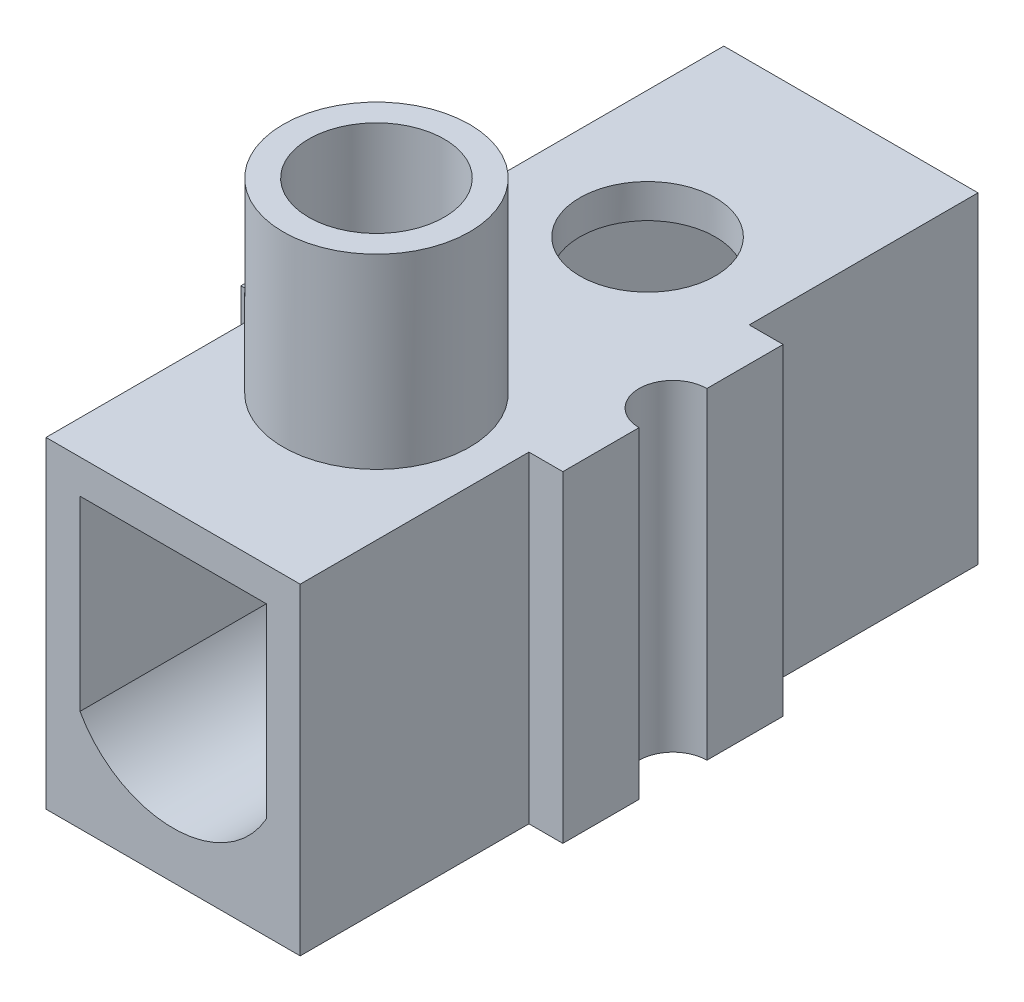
ISO-10303-21;
HEADER;
FILE_DESCRIPTION(('STEP AP214'),'2;1');
FILE_NAME('part.step','',(''),(''),'','','');
FILE_SCHEMA(('AUTOMOTIVE_DESIGN { 1 0 10303 214 1 1 1 1 }'));
ENDSEC;
DATA;
#1=APPLICATION_CONTEXT('core data for automotive mechanical design processes');
#2=APPLICATION_PROTOCOL_DEFINITION('international standard','automotive_design',2000,#1);
#3=PRODUCT_CONTEXT('',#1,'mechanical');
#4=PRODUCT('Part','Part','',(#3));
#5=PRODUCT_RELATED_PRODUCT_CATEGORY('part','',(#4));
#6=PRODUCT_DEFINITION_FORMATION('','',#4);
#7=PRODUCT_DEFINITION_CONTEXT('part definition',#1,'design');
#8=PRODUCT_DEFINITION('design','',#6,#7);
#9=PRODUCT_DEFINITION_SHAPE('','',#8);
#10=(LENGTH_UNIT() NAMED_UNIT(*) SI_UNIT(.MILLI.,.METRE.));
#11=(NAMED_UNIT(*) PLANE_ANGLE_UNIT() SI_UNIT($,.RADIAN.));
#12=(NAMED_UNIT(*) SI_UNIT($,.STERADIAN.) SOLID_ANGLE_UNIT());
#13=UNCERTAINTY_MEASURE_WITH_UNIT(LENGTH_MEASURE(1.E-05),#10,'distance_accuracy_value','');
#14=(GEOMETRIC_REPRESENTATION_CONTEXT(3) GLOBAL_UNCERTAINTY_ASSIGNED_CONTEXT((#13)) GLOBAL_UNIT_ASSIGNED_CONTEXT((#10,
#11,#12)) REPRESENTATION_CONTEXT('',''));
#15=CARTESIAN_POINT('',(0.,0.,0.));
#16=DIRECTION('',(0.,0.,1.));
#17=DIRECTION('',(1.,0.,0.));
#18=AXIS2_PLACEMENT_3D('',#15,#16,#17);
#19=CARTESIAN_POINT('',(-3.75,0.,10.));
#20=DIRECTION('',(0.,-1.,0.));
#21=DIRECTION('',(0.,0.,-1.));
#22=AXIS2_PLACEMENT_3D('',#19,#20,#21);
#23=PLANE('',#22);
#24=DIRECTION('',(0.,0.,1.));
#25=VECTOR('',#24,1.);
#26=CARTESIAN_POINT('',(-4.75,0.,3.25));
#27=LINE('',#26,#25);
#28=CARTESIAN_POINT('',(-4.75,0.,-3.25));
#29=VERTEX_POINT('',#28);
#30=CARTESIAN_POINT('',(-4.75,0.,-1.));
#31=VERTEX_POINT('',#30);
#32=EDGE_CURVE('E373',#29,#31,#27,.T.);
#33=ORIENTED_EDGE('',*,*,#32,.T.);
#34=CARTESIAN_POINT('',(-4.75,0.,0.));
#35=DIRECTION('',(0.,1.,0.));
#36=DIRECTION('',(0.,0.,-1.));
#37=AXIS2_PLACEMENT_3D('',#34,#35,#36);
#38=CIRCLE('',#37,1.);
#39=CARTESIAN_POINT('',(-4.75,0.,1.));
#40=VERTEX_POINT('',#39);
#41=EDGE_CURVE('E43',#40,#31,#38,.T.);
#42=ORIENTED_EDGE('',*,*,#41,.F.);
#43=CARTESIAN_POINT('',(-4.75,0.,3.25));
#44=VERTEX_POINT('',#43);
#45=EDGE_CURVE('E376',#40,#44,#27,.T.);
#46=ORIENTED_EDGE('',*,*,#45,.T.);
#47=DIRECTION('',(1.,0.,0.));
#48=VECTOR('',#47,1.);
#49=CARTESIAN_POINT('',(-4.75,0.,3.25));
#50=LINE('',#49,#48);
#51=CARTESIAN_POINT('',(-3.75,0.,3.25));
#52=VERTEX_POINT('',#51);
#53=EDGE_CURVE('E299',#44,#52,#50,.T.);
#54=ORIENTED_EDGE('',*,*,#53,.T.);
#55=DIRECTION('',(0.,0.,-1.));
#56=VECTOR('',#55,1.);
#57=CARTESIAN_POINT('',(-3.75,0.,10.));
#58=LINE('',#57,#56);
#59=CARTESIAN_POINT('',(-3.75,0.,10.));
#60=VERTEX_POINT('',#59);
#61=EDGE_CURVE('E263',#60,#52,#58,.T.);
#62=ORIENTED_EDGE('',*,*,#61,.F.);
#63=DIRECTION('',(-1.,0.,0.));
#64=VECTOR('',#63,1.);
#65=CARTESIAN_POINT('',(-3.75,0.,10.));
#66=LINE('',#65,#64);
#67=CARTESIAN_POINT('',(3.75,0.,10.));
#68=VERTEX_POINT('',#67);
#69=EDGE_CURVE('E252',#68,#60,#66,.T.);
#70=ORIENTED_EDGE('',*,*,#69,.F.);
#71=DIRECTION('',(0.,0.,-1.));
#72=VECTOR('',#71,1.);
#73=CARTESIAN_POINT('',(3.75,0.,10.));
#74=LINE('',#73,#72);
#75=CARTESIAN_POINT('',(3.75,0.,3.25));
#76=VERTEX_POINT('',#75);
#77=EDGE_CURVE('E275',#68,#76,#74,.T.);
#78=ORIENTED_EDGE('',*,*,#77,.T.);
#79=DIRECTION('',(-1.,0.,0.));
#80=VECTOR('',#79,1.);
#81=CARTESIAN_POINT('',(4.75,0.,3.25));
#82=LINE('',#81,#80);
#83=CARTESIAN_POINT('',(4.75,0.,3.25));
#84=VERTEX_POINT('',#83);
#85=EDGE_CURVE('E200',#84,#76,#82,.T.);
#86=ORIENTED_EDGE('',*,*,#85,.F.);
#87=DIRECTION('',(0.,0.,1.));
#88=VECTOR('',#87,1.);
#89=CARTESIAN_POINT('',(4.75,0.,3.25));
#90=LINE('',#89,#88);
#91=CARTESIAN_POINT('',(4.75,0.,1.));
#92=VERTEX_POINT('',#91);
#93=EDGE_CURVE('E192',#92,#84,#90,.T.);
#94=ORIENTED_EDGE('',*,*,#93,.F.);
#95=CARTESIAN_POINT('',(4.75,0.,0.));
#96=DIRECTION('',(0.,1.,0.));
#97=DIRECTION('',(0.,0.,1.));
#98=AXIS2_PLACEMENT_3D('',#95,#96,#97);
#99=CIRCLE('',#98,1.);
#100=CARTESIAN_POINT('',(4.75,0.,-1.));
#101=VERTEX_POINT('',#100);
#102=EDGE_CURVE('E168',#101,#92,#99,.T.);
#103=ORIENTED_EDGE('',*,*,#102,.F.);
#104=CARTESIAN_POINT('',(4.75,0.,-3.25));
#105=VERTEX_POINT('',#104);
#106=EDGE_CURVE('E197',#105,#101,#90,.T.);
#107=ORIENTED_EDGE('',*,*,#106,.F.);
#108=DIRECTION('',(-1.,0.,0.));
#109=VECTOR('',#108,1.);
#110=CARTESIAN_POINT('',(4.75,0.,-3.25));
#111=LINE('',#110,#109);
#112=CARTESIAN_POINT('',(3.75,0.,-3.25));
#113=VERTEX_POINT('',#112);
#114=EDGE_CURVE('E287',#105,#113,#111,.T.);
#115=ORIENTED_EDGE('',*,*,#114,.T.);
#116=CARTESIAN_POINT('',(3.75,0.,-10.));
#117=VERTEX_POINT('',#116);
#118=EDGE_CURVE('E266',#113,#117,#74,.T.);
#119=ORIENTED_EDGE('',*,*,#118,.T.);
#120=DIRECTION('',(-1.,0.,0.));
#121=VECTOR('',#120,1.);
#122=CARTESIAN_POINT('',(-3.75,0.,-10.));
#123=LINE('',#122,#121);
#124=CARTESIAN_POINT('',(-3.75,0.,-10.));
#125=VERTEX_POINT('',#124);
#126=EDGE_CURVE('E242',#117,#125,#123,.T.);
#127=ORIENTED_EDGE('',*,*,#126,.T.);
#128=CARTESIAN_POINT('',(-3.75,0.,-3.25));
#129=VERTEX_POINT('',#128);
#130=EDGE_CURVE('E254',#129,#125,#58,.T.);
#131=ORIENTED_EDGE('',*,*,#130,.F.);
#132=DIRECTION('',(1.,0.,0.));
#133=VECTOR('',#132,1.);
#134=CARTESIAN_POINT('',(-4.75,0.,-3.25));
#135=LINE('',#134,#133);
#136=EDGE_CURVE('E360',#29,#129,#135,.T.);
#137=ORIENTED_EDGE('',*,*,#136,.F.);
#138=EDGE_LOOP('',(#33,#42,#46,#54,#62,#70,#78,#86,#94,#103,#107,#115,#119,#127,#131,#137));
#139=FACE_BOUND('',#138,.T.);
#140=CARTESIAN_POINT('',(0.,0.,-4.));
#141=DIRECTION('',(0.,1.,0.));
#142=DIRECTION('',(0.,0.,1.));
#143=AXIS2_PLACEMENT_3D('',#140,#141,#142);
#144=CIRCLE('',#143,2.);
#145=CARTESIAN_POINT('',(0.,0.,-2.));
#146=VERTEX_POINT('',#145);
#147=EDGE_CURVE('E391',#146,#146,#144,.T.);
#148=ORIENTED_EDGE('',*,*,#147,.F.);
#149=EDGE_LOOP('',(#148));
#150=FACE_BOUND('',#149,.T.);
#151=CARTESIAN_POINT('',(0.,0.,4.));
#152=DIRECTION('',(0.,-1.,0.));
#153=DIRECTION('',(0.,0.,-1.));
#154=AXIS2_PLACEMENT_3D('',#151,#152,#153);
#155=CIRCLE('',#154,2.75);
#156=CARTESIAN_POINT('',(0.,0.,1.25));
#157=VERTEX_POINT('',#156);
#158=EDGE_CURVE('E11',#157,#157,#155,.F.);
#159=ORIENTED_EDGE('',*,*,#158,.F.);
#160=EDGE_LOOP('',(#159));
#161=FACE_BOUND('',#160,.T.);
#162=ADVANCED_FACE('F26',(#139,#150,#161),#23,.F.);
#163=CARTESIAN_POINT('',(-4.75,0.,3.25));
#164=DIRECTION('',(-1.,0.,0.));
#165=DIRECTION('',(0.,1.,0.));
#166=AXIS2_PLACEMENT_3D('',#163,#164,#165);
#167=PLANE('',#166);
#168=DIRECTION('',(0.,1.,0.));
#169=VECTOR('',#168,1.);
#170=CARTESIAN_POINT('',(-4.75,-9.50005,0.999999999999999));
#171=LINE('',#170,#169);
#172=CARTESIAN_POINT('',(-4.75,-9.5,0.999999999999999));
#173=VERTEX_POINT('',#172);
#174=EDGE_CURVE('E35',#173,#40,#171,.T.);
#175=ORIENTED_EDGE('',*,*,#174,.F.);
#176=DIRECTION('',(0.,0.,-1.));
#177=VECTOR('',#176,1.);
#178=CARTESIAN_POINT('',(-4.75,-9.5,3.25));
#179=LINE('',#178,#177);
#180=CARTESIAN_POINT('',(-4.75,-9.5,3.25));
#181=VERTEX_POINT('',#180);
#182=EDGE_CURVE('E293',#181,#173,#179,.T.);
#183=ORIENTED_EDGE('',*,*,#182,.F.);
#184=DIRECTION('',(0.,-1.,0.));
#185=VECTOR('',#184,1.);
#186=CARTESIAN_POINT('',(-4.75,0.,3.25));
#187=LINE('',#186,#185);
#188=EDGE_CURVE('E345',#44,#181,#187,.T.);
#189=ORIENTED_EDGE('',*,*,#188,.F.);
#190=ORIENTED_EDGE('',*,*,#45,.F.);
#191=EDGE_LOOP('',(#175,#183,#189,#190));
#192=FACE_BOUND('',#191,.T.);
#193=ADVANCED_FACE('F382',(#192),#167,.T.);
#194=CARTESIAN_POINT('',(4.75,0.,3.25));
#195=DIRECTION('',(1.,0.,0.));
#196=DIRECTION('',(0.,1.,0.));
#197=AXIS2_PLACEMENT_3D('',#194,#195,#196);
#198=PLANE('',#197);
#199=DIRECTION('',(0.,1.,0.));
#200=VECTOR('',#199,1.);
#201=CARTESIAN_POINT('',(4.75,-9.50005,-1.));
#202=LINE('',#201,#200);
#203=CARTESIAN_POINT('',(4.75,-9.5,-1.));
#204=VERTEX_POINT('',#203);
#205=EDGE_CURVE('E172',#204,#101,#202,.T.);
#206=ORIENTED_EDGE('',*,*,#205,.F.);
#207=DIRECTION('',(0.,0.,-1.));
#208=VECTOR('',#207,1.);
#209=CARTESIAN_POINT('',(4.75,-9.5,3.25));
#210=LINE('',#209,#208);
#211=CARTESIAN_POINT('',(4.75,-9.5,-3.25));
#212=VERTEX_POINT('',#211);
#213=EDGE_CURVE('E183',#204,#212,#210,.T.);
#214=ORIENTED_EDGE('',*,*,#213,.T.);
#215=DIRECTION('',(0.,1.,0.));
#216=VECTOR('',#215,1.);
#217=CARTESIAN_POINT('',(4.75,0.,-3.25));
#218=LINE('',#217,#216);
#219=EDGE_CURVE('E190',#212,#105,#218,.T.);
#220=ORIENTED_EDGE('',*,*,#219,.T.);
#221=ORIENTED_EDGE('',*,*,#106,.T.);
#222=EDGE_LOOP('',(#206,#214,#220,#221));
#223=FACE_BOUND('',#222,.T.);
#224=ADVANCED_FACE('F427',(#223),#198,.T.);
#225=CARTESIAN_POINT('',(-3.75,0.,10.));
#226=DIRECTION('',(1.,0.,0.));
#227=DIRECTION('',(0.,1.,0.));
#228=AXIS2_PLACEMENT_3D('',#225,#226,#227);
#229=PLANE('',#228);
#230=ORIENTED_EDGE('',*,*,#61,.T.);
#231=DIRECTION('',(0.,-1.,0.));
#232=VECTOR('',#231,1.);
#233=CARTESIAN_POINT('',(-3.75,0.,3.25));
#234=LINE('',#233,#232);
#235=CARTESIAN_POINT('',(-3.75,-9.5,3.25));
#236=VERTEX_POINT('',#235);
#237=EDGE_CURVE('E184',#52,#236,#234,.T.);
#238=ORIENTED_EDGE('',*,*,#237,.T.);
#239=DIRECTION('',(0.,0.,-1.));
#240=VECTOR('',#239,1.);
#241=CARTESIAN_POINT('',(-3.75,-9.5,10.));
#242=LINE('',#241,#240);
#243=CARTESIAN_POINT('',(-3.75,-9.5,10.));
#244=VERTEX_POINT('',#243);
#245=EDGE_CURVE('E173',#244,#236,#242,.T.);
#246=ORIENTED_EDGE('',*,*,#245,.F.);
#247=DIRECTION('',(0.,-1.,0.));
#248=VECTOR('',#247,1.);
#249=CARTESIAN_POINT('',(-3.75,0.,10.));
#250=LINE('',#249,#248);
#251=EDGE_CURVE('E245',#60,#244,#250,.T.);
#252=ORIENTED_EDGE('',*,*,#251,.F.);
#253=EDGE_LOOP('',(#230,#238,#246,#252));
#254=FACE_BOUND('',#253,.T.);
#255=ADVANCED_FACE('F338',(#254),#229,.F.);
#256=CARTESIAN_POINT('',(3.75,0.,10.));
#257=DIRECTION('',(-1.,0.,0.));
#258=DIRECTION('',(0.,-1.,0.));
#259=AXIS2_PLACEMENT_3D('',#256,#257,#258);
#260=PLANE('',#259);
#261=DIRECTION('',(0.,-1.,0.));
#262=VECTOR('',#261,1.);
#263=CARTESIAN_POINT('',(3.75,0.,3.25));
#264=LINE('',#263,#262);
#265=CARTESIAN_POINT('',(3.75,-9.5,3.25));
#266=VERTEX_POINT('',#265);
#267=EDGE_CURVE('E286',#76,#266,#264,.T.);
#268=ORIENTED_EDGE('',*,*,#267,.F.);
#269=ORIENTED_EDGE('',*,*,#77,.F.);
#270=DIRECTION('',(0.,1.,0.));
#271=VECTOR('',#270,1.);
#272=CARTESIAN_POINT('',(3.75,0.,10.));
#273=LINE('',#272,#271);
#274=CARTESIAN_POINT('',(3.75,-9.5,10.));
#275=VERTEX_POINT('',#274);
#276=EDGE_CURVE('E250',#275,#68,#273,.T.);
#277=ORIENTED_EDGE('',*,*,#276,.F.);
#278=DIRECTION('',(0.,0.,-1.));
#279=VECTOR('',#278,1.);
#280=CARTESIAN_POINT('',(3.75,-9.5,10.));
#281=LINE('',#280,#279);
#282=EDGE_CURVE('E270',#275,#266,#281,.T.);
#283=ORIENTED_EDGE('',*,*,#282,.T.);
#284=EDGE_LOOP('',(#268,#269,#277,#283));
#285=FACE_BOUND('',#284,.T.);
#286=ADVANCED_FACE('F323',(#285),#260,.F.);
#287=DIRECTION('',(0.,1.,0.));
#288=VECTOR('',#287,1.);
#289=CARTESIAN_POINT('',(3.75,0.,-3.25));
#290=LINE('',#289,#288);
#291=CARTESIAN_POINT('',(3.75,-9.5,-3.25));
#292=VERTEX_POINT('',#291);
#293=EDGE_CURVE('E283',#292,#113,#290,.T.);
#294=ORIENTED_EDGE('',*,*,#293,.F.);
#295=CARTESIAN_POINT('',(3.75,-9.5,-10.));
#296=VERTEX_POINT('',#295);
#297=EDGE_CURVE('E279',#292,#296,#281,.T.);
#298=ORIENTED_EDGE('',*,*,#297,.T.);
#299=DIRECTION('',(0.,1.,0.));
#300=VECTOR('',#299,1.);
#301=CARTESIAN_POINT('',(3.75,0.,-10.));
#302=LINE('',#301,#300);
#303=EDGE_CURVE('E239',#296,#117,#302,.T.);
#304=ORIENTED_EDGE('',*,*,#303,.T.);
#305=ORIENTED_EDGE('',*,*,#118,.F.);
#306=EDGE_LOOP('',(#294,#298,#304,#305));
#307=FACE_BOUND('',#306,.T.);
#308=ADVANCED_FACE('F434',(#307),#260,.F.);
#309=CARTESIAN_POINT('',(-3.75,-9.5,10.));
#310=DIRECTION('',(0.,0.,1.));
#311=DIRECTION('',(1.,0.,0.));
#312=AXIS2_PLACEMENT_3D('',#309,#310,#311);
#313=PLANE('',#312);
#314=ORIENTED_EDGE('',*,*,#251,.T.);
#315=DIRECTION('',(1.,0.,0.));
#316=VECTOR('',#315,1.);
#317=CARTESIAN_POINT('',(-3.75,-9.5,10.));
#318=LINE('',#317,#316);
#319=EDGE_CURVE('E248',#244,#275,#318,.T.);
#320=ORIENTED_EDGE('',*,*,#319,.T.);
#321=ORIENTED_EDGE('',*,*,#276,.T.);
#322=ORIENTED_EDGE('',*,*,#69,.T.);
#323=EDGE_LOOP('',(#314,#320,#321,#322));
#324=FACE_BOUND('',#323,.T.);
#325=CARTESIAN_POINT('',(0.00129666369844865,-4.96145199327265,10.));
#326=DIRECTION('',(0.,0.,1.));
#327=DIRECTION('',(1.,0.,0.));
#328=AXIS2_PLACEMENT_3D('',#325,#326,#327);
#329=CIRCLE('',#328,3.15);
#330=CARTESIAN_POINT('',(-2.74740667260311,-6.5,10.));
#331=VERTEX_POINT('',#330);
#332=CARTESIAN_POINT('',(2.75,-6.5,10.));
#333=VERTEX_POINT('',#332);
#334=EDGE_CURVE('E216',#331,#333,#329,.T.);
#335=ORIENTED_EDGE('',*,*,#334,.F.);
#336=DIRECTION('',(0.,-1.,0.));
#337=VECTOR('',#336,1.);
#338=CARTESIAN_POINT('',(-2.74740667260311,-1.,10.));
#339=LINE('',#338,#337);
#340=CARTESIAN_POINT('',(-2.74740667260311,-1.,10.));
#341=VERTEX_POINT('',#340);
#342=EDGE_CURVE('E214',#341,#331,#339,.T.);
#343=ORIENTED_EDGE('',*,*,#342,.F.);
#344=DIRECTION('',(-1.,0.,0.));
#345=VECTOR('',#344,1.);
#346=CARTESIAN_POINT('',(-2.74740667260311,-1.,10.));
#347=LINE('',#346,#345);
#348=CARTESIAN_POINT('',(2.75,-1.,10.));
#349=VERTEX_POINT('',#348);
#350=EDGE_CURVE('E221',#349,#341,#347,.T.);
#351=ORIENTED_EDGE('',*,*,#350,.F.);
#352=DIRECTION('',(0.,1.,0.));
#353=VECTOR('',#352,1.);
#354=CARTESIAN_POINT('',(2.75,-1.,10.));
#355=LINE('',#354,#353);
#356=EDGE_CURVE('E218',#333,#349,#355,.T.);
#357=ORIENTED_EDGE('',*,*,#356,.F.);
#358=EDGE_LOOP('',(#335,#343,#351,#357));
#359=FACE_BOUND('',#358,.T.);
#360=ADVANCED_FACE('F330',(#324,#359),#313,.T.);
#361=CARTESIAN_POINT('',(-3.75,-9.5,-10.));
#362=DIRECTION('',(0.,0.,1.));
#363=DIRECTION('',(1.,0.,0.));
#364=AXIS2_PLACEMENT_3D('',#361,#362,#363);
#365=PLANE('',#364);
#366=DIRECTION('',(0.,-1.,0.));
#367=VECTOR('',#366,1.);
#368=CARTESIAN_POINT('',(-3.75,0.,-10.));
#369=LINE('',#368,#367);
#370=CARTESIAN_POINT('',(-3.75,-9.5,-10.));
#371=VERTEX_POINT('',#370);
#372=EDGE_CURVE('E233',#125,#371,#369,.T.);
#373=ORIENTED_EDGE('',*,*,#372,.F.);
#374=ORIENTED_EDGE('',*,*,#126,.F.);
#375=ORIENTED_EDGE('',*,*,#303,.F.);
#376=DIRECTION('',(1.,0.,0.));
#377=VECTOR('',#376,1.);
#378=CARTESIAN_POINT('',(-3.75,-9.5,-10.));
#379=LINE('',#378,#377);
#380=EDGE_CURVE('E236',#371,#296,#379,.T.);
#381=ORIENTED_EDGE('',*,*,#380,.F.);
#382=EDGE_LOOP('',(#373,#374,#375,#381));
#383=FACE_BOUND('',#382,.T.);
#384=DIRECTION('',(0.,-1.,0.));
#385=VECTOR('',#384,1.);
#386=CARTESIAN_POINT('',(-2.74740667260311,-1.,-10.));
#387=LINE('',#386,#385);
#388=CARTESIAN_POINT('',(-2.74740667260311,-1.,-10.));
#389=VERTEX_POINT('',#388);
#390=CARTESIAN_POINT('',(-2.74740667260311,-6.5,-10.));
#391=VERTEX_POINT('',#390);
#392=EDGE_CURVE('E201',#389,#391,#387,.T.);
#393=ORIENTED_EDGE('',*,*,#392,.T.);
#394=CARTESIAN_POINT('',(0.00129666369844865,-4.96145199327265,-10.));
#395=DIRECTION('',(0.,0.,1.));
#396=DIRECTION('',(1.,0.,0.));
#397=AXIS2_PLACEMENT_3D('',#394,#395,#396);
#398=CIRCLE('',#397,3.15);
#399=CARTESIAN_POINT('',(2.75,-6.5,-10.));
#400=VERTEX_POINT('',#399);
#401=EDGE_CURVE('E204',#391,#400,#398,.T.);
#402=ORIENTED_EDGE('',*,*,#401,.T.);
#403=DIRECTION('',(0.,1.,0.));
#404=VECTOR('',#403,1.);
#405=CARTESIAN_POINT('',(2.75,-1.,-10.));
#406=LINE('',#405,#404);
#407=CARTESIAN_POINT('',(2.75,-1.,-10.));
#408=VERTEX_POINT('',#407);
#409=EDGE_CURVE('E208',#400,#408,#406,.T.);
#410=ORIENTED_EDGE('',*,*,#409,.T.);
#411=DIRECTION('',(-1.,0.,0.));
#412=VECTOR('',#411,1.);
#413=CARTESIAN_POINT('',(-2.74740667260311,-1.,-10.));
#414=LINE('',#413,#412);
#415=EDGE_CURVE('E211',#408,#389,#414,.T.);
#416=ORIENTED_EDGE('',*,*,#415,.T.);
#417=EDGE_LOOP('',(#393,#402,#410,#416));
#418=FACE_BOUND('',#417,.T.);
#419=ADVANCED_FACE('F446',(#383,#418),#365,.F.);
#420=CARTESIAN_POINT('',(-3.75,-9.5,-3.25));
#421=VERTEX_POINT('',#420);
#422=EDGE_CURVE('E267',#421,#371,#242,.T.);
#423=ORIENTED_EDGE('',*,*,#422,.F.);
#424=DIRECTION('',(0.,1.,0.));
#425=VECTOR('',#424,1.);
#426=CARTESIAN_POINT('',(-3.75,0.,-3.25));
#427=LINE('',#426,#425);
#428=EDGE_CURVE('E342',#421,#129,#427,.T.);
#429=ORIENTED_EDGE('',*,*,#428,.T.);
#430=ORIENTED_EDGE('',*,*,#130,.T.);
#431=ORIENTED_EDGE('',*,*,#372,.T.);
#432=EDGE_LOOP('',(#423,#429,#430,#431));
#433=FACE_BOUND('',#432,.T.);
#434=ADVANCED_FACE('F28',(#433),#229,.F.);
#435=CARTESIAN_POINT('',(-3.75,-9.5,10.));
#436=DIRECTION('',(0.,1.,0.));
#437=DIRECTION('',(0.,0.,1.));
#438=AXIS2_PLACEMENT_3D('',#435,#436,#437);
#439=PLANE('',#438);
#440=ORIENTED_EDGE('',*,*,#182,.T.);
#441=CARTESIAN_POINT('',(-4.75,-9.5,0.));
#442=DIRECTION('',(0.,1.,0.));
#443=DIRECTION('',(0.,0.,1.));
#444=AXIS2_PLACEMENT_3D('',#441,#442,#443);
#445=CIRCLE('',#444,1.);
#446=CARTESIAN_POINT('',(-4.75,-9.5,-1.));
#447=VERTEX_POINT('',#446);
#448=EDGE_CURVE('E55',#173,#447,#445,.T.);
#449=ORIENTED_EDGE('',*,*,#448,.T.);
#450=CARTESIAN_POINT('',(-4.75,-9.5,-3.25));
#451=VERTEX_POINT('',#450);
#452=EDGE_CURVE('E367',#447,#451,#179,.T.);
#453=ORIENTED_EDGE('',*,*,#452,.T.);
#454=DIRECTION('',(1.,0.,0.));
#455=VECTOR('',#454,1.);
#456=CARTESIAN_POINT('',(-4.75,-9.5,-3.25));
#457=LINE('',#456,#455);
#458=EDGE_CURVE('E362',#451,#421,#457,.T.);
#459=ORIENTED_EDGE('',*,*,#458,.T.);
#460=ORIENTED_EDGE('',*,*,#422,.T.);
#461=ORIENTED_EDGE('',*,*,#380,.T.);
#462=ORIENTED_EDGE('',*,*,#297,.F.);
#463=DIRECTION('',(-1.,0.,0.));
#464=VECTOR('',#463,1.);
#465=CARTESIAN_POINT('',(4.75,-9.5,-3.25));
#466=LINE('',#465,#464);
#467=EDGE_CURVE('E307',#212,#292,#466,.T.);
#468=ORIENTED_EDGE('',*,*,#467,.F.);
#469=ORIENTED_EDGE('',*,*,#213,.F.);
#470=CARTESIAN_POINT('',(4.75,-9.5,0.));
#471=DIRECTION('',(0.,1.,0.));
#472=DIRECTION('',(0.,0.,1.));
#473=AXIS2_PLACEMENT_3D('',#470,#471,#472);
#474=CIRCLE('',#473,1.);
#475=CARTESIAN_POINT('',(4.75,-9.5,0.999999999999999));
#476=VERTEX_POINT('',#475);
#477=EDGE_CURVE('E162',#204,#476,#474,.T.);
#478=ORIENTED_EDGE('',*,*,#477,.T.);
#479=CARTESIAN_POINT('',(4.75,-9.5,3.25));
#480=VERTEX_POINT('',#479);
#481=EDGE_CURVE('E180',#480,#476,#210,.T.);
#482=ORIENTED_EDGE('',*,*,#481,.F.);
#483=DIRECTION('',(-1.,0.,0.));
#484=VECTOR('',#483,1.);
#485=CARTESIAN_POINT('',(4.75,-9.5,3.25));
#486=LINE('',#485,#484);
#487=EDGE_CURVE('E205',#480,#266,#486,.T.);
#488=ORIENTED_EDGE('',*,*,#487,.T.);
#489=ORIENTED_EDGE('',*,*,#282,.F.);
#490=ORIENTED_EDGE('',*,*,#319,.F.);
#491=ORIENTED_EDGE('',*,*,#245,.T.);
#492=DIRECTION('',(1.,0.,0.));
#493=VECTOR('',#492,1.);
#494=CARTESIAN_POINT('',(-4.75,-9.5,3.25));
#495=LINE('',#494,#493);
#496=EDGE_CURVE('E334',#181,#236,#495,.T.);
#497=ORIENTED_EDGE('',*,*,#496,.F.);
#498=EDGE_LOOP('',(#440,#449,#453,#459,#460,#461,#462,#468,#469,#478,#482,#488,#489,#490,#491,#497));
#499=FACE_BOUND('',#498,.T.);
#500=ADVANCED_FACE('F178',(#499),#439,.F.);
#501=CARTESIAN_POINT('',(-2.74740667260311,-1.,10.));
#502=DIRECTION('',(1.,0.,0.));
#503=DIRECTION('',(0.,1.,0.));
#504=AXIS2_PLACEMENT_3D('',#501,#502,#503);
#505=PLANE('',#504);
#506=ORIENTED_EDGE('',*,*,#392,.F.);
#507=DIRECTION('',(0.,0.,-1.));
#508=VECTOR('',#507,1.);
#509=CARTESIAN_POINT('',(-2.74740667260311,-1.,10.));
#510=LINE('',#509,#508);
#511=EDGE_CURVE('E223',#341,#389,#510,.T.);
#512=ORIENTED_EDGE('',*,*,#511,.F.);
#513=ORIENTED_EDGE('',*,*,#342,.T.);
#514=DIRECTION('',(0.,0.,-1.));
#515=VECTOR('',#514,1.);
#516=CARTESIAN_POINT('',(-2.74740667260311,-6.5,10.));
#517=LINE('',#516,#515);
#518=EDGE_CURVE('E230',#331,#391,#517,.T.);
#519=ORIENTED_EDGE('',*,*,#518,.T.);
#520=EDGE_LOOP('',(#506,#512,#513,#519));
#521=FACE_BOUND('',#520,.T.);
#522=ADVANCED_FACE('F436',(#521),#505,.T.);
#523=CARTESIAN_POINT('',(0.00129666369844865,-4.96145199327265,10.));
#524=DIRECTION('',(0.,0.,-1.));
#525=DIRECTION('',(-1.,0.,0.));
#526=AXIS2_PLACEMENT_3D('',#523,#524,#525);
#527=CYLINDRICAL_SURFACE('',#526,3.15);
#528=ORIENTED_EDGE('',*,*,#401,.F.);
#529=ORIENTED_EDGE('',*,*,#518,.F.);
#530=ORIENTED_EDGE('',*,*,#334,.T.);
#531=DIRECTION('',(0.,0.,-1.));
#532=VECTOR('',#531,1.);
#533=CARTESIAN_POINT('',(2.75,-6.5,10.));
#534=LINE('',#533,#532);
#535=EDGE_CURVE('E228',#333,#400,#534,.T.);
#536=ORIENTED_EDGE('',*,*,#535,.T.);
#537=EDGE_LOOP('',(#528,#529,#530,#536));
#538=FACE_BOUND('',#537,.T.);
#539=ADVANCED_FACE('F442',(#538),#527,.F.);
#540=CARTESIAN_POINT('',(2.75,-1.,10.));
#541=DIRECTION('',(-1.,0.,0.));
#542=DIRECTION('',(0.,-1.,0.));
#543=AXIS2_PLACEMENT_3D('',#540,#541,#542);
#544=PLANE('',#543);
#545=ORIENTED_EDGE('',*,*,#409,.F.);
#546=ORIENTED_EDGE('',*,*,#535,.F.);
#547=ORIENTED_EDGE('',*,*,#356,.T.);
#548=DIRECTION('',(0.,0.,-1.));
#549=VECTOR('',#548,1.);
#550=CARTESIAN_POINT('',(2.75,-1.,10.));
#551=LINE('',#550,#549);
#552=EDGE_CURVE('E226',#349,#408,#551,.T.);
#553=ORIENTED_EDGE('',*,*,#552,.T.);
#554=EDGE_LOOP('',(#545,#546,#547,#553));
#555=FACE_BOUND('',#554,.T.);
#556=ADVANCED_FACE('F477',(#555),#544,.T.);
#557=CARTESIAN_POINT('',(-2.74740667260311,-1.,10.));
#558=DIRECTION('',(0.,-1.,0.));
#559=DIRECTION('',(0.,0.,-1.));
#560=AXIS2_PLACEMENT_3D('',#557,#558,#559);
#561=PLANE('',#560);
#562=CARTESIAN_POINT('',(0.,-1.,-4.));
#563=DIRECTION('',(0.,-1.,0.));
#564=DIRECTION('',(0.,0.,-1.));
#565=AXIS2_PLACEMENT_3D('',#562,#563,#564);
#566=CIRCLE('',#565,2.);
#567=CARTESIAN_POINT('',(0.,-1.,-6.));
#568=VERTEX_POINT('',#567);
#569=EDGE_CURVE('E389',#568,#568,#566,.T.);
#570=ORIENTED_EDGE('',*,*,#569,.F.);
#571=EDGE_LOOP('',(#570));
#572=FACE_BOUND('',#571,.T.);
#573=CARTESIAN_POINT('',(0.,-1.,4.));
#574=DIRECTION('',(0.,-1.,0.));
#575=DIRECTION('',(0.,0.,-1.));
#576=AXIS2_PLACEMENT_3D('',#573,#574,#575);
#577=CIRCLE('',#576,2.);
#578=CARTESIAN_POINT('',(0.,-1.,2.));
#579=VERTEX_POINT('',#578);
#580=EDGE_CURVE('E387',#579,#579,#577,.T.);
#581=ORIENTED_EDGE('',*,*,#580,.F.);
#582=EDGE_LOOP('',(#581));
#583=FACE_BOUND('',#582,.T.);
#584=ORIENTED_EDGE('',*,*,#415,.F.);
#585=ORIENTED_EDGE('',*,*,#552,.F.);
#586=ORIENTED_EDGE('',*,*,#350,.T.);
#587=ORIENTED_EDGE('',*,*,#511,.T.);
#588=EDGE_LOOP('',(#584,#585,#586,#587));
#589=FACE_BOUND('',#588,.T.);
#590=ADVANCED_FACE('F472',(#572,#583,#589),#561,.T.);
#591=CARTESIAN_POINT('',(4.75,0.,3.25));
#592=DIRECTION('',(0.,0.,-1.));
#593=DIRECTION('',(0.,1.,0.));
#594=AXIS2_PLACEMENT_3D('',#591,#592,#593);
#595=PLANE('',#594);
#596=ORIENTED_EDGE('',*,*,#267,.T.);
#597=ORIENTED_EDGE('',*,*,#487,.F.);
#598=DIRECTION('',(0.,-1.,0.));
#599=VECTOR('',#598,1.);
#600=CARTESIAN_POINT('',(4.75,0.,3.25));
#601=LINE('',#600,#599);
#602=EDGE_CURVE('E188',#84,#480,#601,.T.);
#603=ORIENTED_EDGE('',*,*,#602,.F.);
#604=ORIENTED_EDGE('',*,*,#85,.T.);
#605=EDGE_LOOP('',(#596,#597,#603,#604));
#606=FACE_BOUND('',#605,.T.);
#607=ADVANCED_FACE('F320',(#606),#595,.F.);
#608=CARTESIAN_POINT('',(4.75,0.,-3.25));
#609=DIRECTION('',(0.,0.,1.));
#610=DIRECTION('',(0.,-1.,0.));
#611=AXIS2_PLACEMENT_3D('',#608,#609,#610);
#612=PLANE('',#611);
#613=ORIENTED_EDGE('',*,*,#293,.T.);
#614=ORIENTED_EDGE('',*,*,#114,.F.);
#615=ORIENTED_EDGE('',*,*,#219,.F.);
#616=ORIENTED_EDGE('',*,*,#467,.T.);
#617=EDGE_LOOP('',(#613,#614,#615,#616));
#618=FACE_BOUND('',#617,.T.);
#619=ADVANCED_FACE('F464',(#618),#612,.F.);
#620=DIRECTION('',(0.,1.,0.));
#621=VECTOR('',#620,1.);
#622=CARTESIAN_POINT('',(4.75,-9.50005,0.999999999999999));
#623=LINE('',#622,#621);
#624=EDGE_CURVE('E165',#92,#476,#623,.F.);
#625=ORIENTED_EDGE('',*,*,#624,.F.);
#626=ORIENTED_EDGE('',*,*,#93,.T.);
#627=ORIENTED_EDGE('',*,*,#602,.T.);
#628=ORIENTED_EDGE('',*,*,#481,.T.);
#629=EDGE_LOOP('',(#625,#626,#627,#628));
#630=FACE_BOUND('',#629,.T.);
#631=ADVANCED_FACE('F186',(#630),#198,.T.);
#632=CARTESIAN_POINT('',(-4.75,0.,3.25));
#633=DIRECTION('',(0.,0.,1.));
#634=DIRECTION('',(0.,-1.,0.));
#635=AXIS2_PLACEMENT_3D('',#632,#633,#634);
#636=PLANE('',#635);
#637=ORIENTED_EDGE('',*,*,#237,.F.);
#638=ORIENTED_EDGE('',*,*,#53,.F.);
#639=ORIENTED_EDGE('',*,*,#188,.T.);
#640=ORIENTED_EDGE('',*,*,#496,.T.);
#641=EDGE_LOOP('',(#637,#638,#639,#640));
#642=FACE_BOUND('',#641,.T.);
#643=ADVANCED_FACE('F380',(#642),#636,.T.);
#644=CARTESIAN_POINT('',(-4.75,0.,-3.25));
#645=DIRECTION('',(0.,0.,-1.));
#646=DIRECTION('',(0.,1.,0.));
#647=AXIS2_PLACEMENT_3D('',#644,#645,#646);
#648=PLANE('',#647);
#649=ORIENTED_EDGE('',*,*,#428,.F.);
#650=ORIENTED_EDGE('',*,*,#458,.F.);
#651=DIRECTION('',(0.,1.,0.));
#652=VECTOR('',#651,1.);
#653=CARTESIAN_POINT('',(-4.75,0.,-3.25));
#654=LINE('',#653,#652);
#655=EDGE_CURVE('E369',#451,#29,#654,.T.);
#656=ORIENTED_EDGE('',*,*,#655,.T.);
#657=ORIENTED_EDGE('',*,*,#136,.T.);
#658=EDGE_LOOP('',(#649,#650,#656,#657));
#659=FACE_BOUND('',#658,.T.);
#660=ADVANCED_FACE('F468',(#659),#648,.T.);
#661=DIRECTION('',(0.,1.,0.));
#662=VECTOR('',#661,1.);
#663=CARTESIAN_POINT('',(-4.75,-9.50005,-1.));
#664=LINE('',#663,#662);
#665=EDGE_CURVE('E60',#31,#447,#664,.F.);
#666=ORIENTED_EDGE('',*,*,#665,.F.);
#667=ORIENTED_EDGE('',*,*,#32,.F.);
#668=ORIENTED_EDGE('',*,*,#655,.F.);
#669=ORIENTED_EDGE('',*,*,#452,.F.);
#670=EDGE_LOOP('',(#666,#667,#668,#669));
#671=FACE_BOUND('',#670,.T.);
#672=ADVANCED_FACE('F429',(#671),#167,.T.);
#673=CARTESIAN_POINT('',(4.75,-9.50005,0.));
#674=DIRECTION('',(0.,1.,0.));
#675=DIRECTION('',(0.,0.,1.));
#676=AXIS2_PLACEMENT_3D('',#673,#674,#675);
#677=CYLINDRICAL_SURFACE('',#676,1.);
#678=ORIENTED_EDGE('',*,*,#205,.T.);
#679=ORIENTED_EDGE('',*,*,#102,.T.);
#680=ORIENTED_EDGE('',*,*,#624,.T.);
#681=ORIENTED_EDGE('',*,*,#477,.F.);
#682=EDGE_LOOP('',(#678,#679,#680,#681));
#683=FACE_BOUND('',#682,.T.);
#684=ADVANCED_FACE('F166',(#683),#677,.F.);
#685=CARTESIAN_POINT('',(-4.75,-9.50005,0.));
#686=DIRECTION('',(0.,1.,0.));
#687=DIRECTION('',(0.,0.,1.));
#688=AXIS2_PLACEMENT_3D('',#685,#686,#687);
#689=CYLINDRICAL_SURFACE('',#688,1.);
#690=ORIENTED_EDGE('',*,*,#174,.T.);
#691=ORIENTED_EDGE('',*,*,#41,.T.);
#692=ORIENTED_EDGE('',*,*,#665,.T.);
#693=ORIENTED_EDGE('',*,*,#448,.F.);
#694=EDGE_LOOP('',(#690,#691,#692,#693));
#695=FACE_BOUND('',#694,.T.);
#696=ADVANCED_FACE('F515',(#695),#689,.F.);
#697=CARTESIAN_POINT('',(0.,-3.,4.));
#698=DIRECTION('',(0.,1.,0.));
#699=DIRECTION('',(0.,0.,1.));
#700=AXIS2_PLACEMENT_3D('',#697,#698,#699);
#701=CYLINDRICAL_SURFACE('',#700,2.);
#702=ORIENTED_EDGE('',*,*,#580,.T.);
#703=EDGE_LOOP('',(#702));
#704=FACE_BOUND('',#703,.T.);
#705=CARTESIAN_POINT('',(0.,5.5,4.));
#706=DIRECTION('',(0.,1.,0.));
#707=DIRECTION('',(0.,0.,1.));
#708=AXIS2_PLACEMENT_3D('',#705,#706,#707);
#709=CIRCLE('',#708,2.);
#710=CARTESIAN_POINT('',(0.,5.5,6.));
#711=VERTEX_POINT('',#710);
#712=EDGE_CURVE('E400',#711,#711,#709,.T.);
#713=ORIENTED_EDGE('',*,*,#712,.T.);
#714=EDGE_LOOP('',(#713));
#715=FACE_BOUND('',#714,.T.);
#716=ADVANCED_FACE('F406',(#704,#715),#701,.F.);
#717=CARTESIAN_POINT('',(0.,-3.,-4.));
#718=DIRECTION('',(0.,1.,0.));
#719=DIRECTION('',(0.,0.,1.));
#720=AXIS2_PLACEMENT_3D('',#717,#718,#719);
#721=CYLINDRICAL_SURFACE('',#720,2.);
#722=ORIENTED_EDGE('',*,*,#569,.T.);
#723=EDGE_LOOP('',(#722));
#724=FACE_BOUND('',#723,.T.);
#725=ORIENTED_EDGE('',*,*,#147,.T.);
#726=EDGE_LOOP('',(#725));
#727=FACE_BOUND('',#726,.T.);
#728=ADVANCED_FACE('F411',(#724,#727),#721,.F.);
#729=CARTESIAN_POINT('',(0.,5.5,4.));
#730=DIRECTION('',(0.,1.,0.));
#731=DIRECTION('',(0.,0.,1.));
#732=AXIS2_PLACEMENT_3D('',#729,#730,#731);
#733=PLANE('',#732);
#734=CARTESIAN_POINT('',(0.,5.5,4.));
#735=DIRECTION('',(0.,1.,0.));
#736=DIRECTION('',(0.,0.,1.));
#737=AXIS2_PLACEMENT_3D('',#734,#735,#736);
#738=CIRCLE('',#737,2.75);
#739=CARTESIAN_POINT('',(0.,5.5,6.75));
#740=VERTEX_POINT('',#739);
#741=EDGE_CURVE('E395',#740,#740,#738,.T.);
#742=ORIENTED_EDGE('',*,*,#741,.T.);
#743=EDGE_LOOP('',(#742));
#744=FACE_BOUND('',#743,.T.);
#745=ORIENTED_EDGE('',*,*,#712,.F.);
#746=EDGE_LOOP('',(#745));
#747=FACE_BOUND('',#746,.T.);
#748=ADVANCED_FACE('F408',(#744,#747),#733,.T.);
#749=CARTESIAN_POINT('',(0.,5.5,4.));
#750=DIRECTION('',(0.,-1.,0.));
#751=DIRECTION('',(0.,0.,-1.));
#752=AXIS2_PLACEMENT_3D('',#749,#750,#751);
#753=CYLINDRICAL_SURFACE('',#752,2.75);
#754=ORIENTED_EDGE('',*,*,#741,.F.);
#755=EDGE_LOOP('',(#754));
#756=FACE_BOUND('',#755,.T.);
#757=ORIENTED_EDGE('',*,*,#158,.T.);
#758=EDGE_LOOP('',(#757));
#759=FACE_BOUND('',#758,.T.);
#760=ADVANCED_FACE('F410',(#756,#759),#753,.T.);
#761=CLOSED_SHELL('',(#162,#193,#224,#255,#286,#308,#360,#419,#434,#500,#522,#539,#556,#590,
#607,#619,#631,#643,#660,#672,#684,#696,#716,#728,#748,#760));
#762=MANIFOLD_SOLID_BREP('B2',#761);
#763=ADVANCED_BREP_SHAPE_REPRESENTATION('',(#18,#762),#14);
#764=SHAPE_DEFINITION_REPRESENTATION(#9,#763);
ENDSEC;
END-ISO-10303-21;
